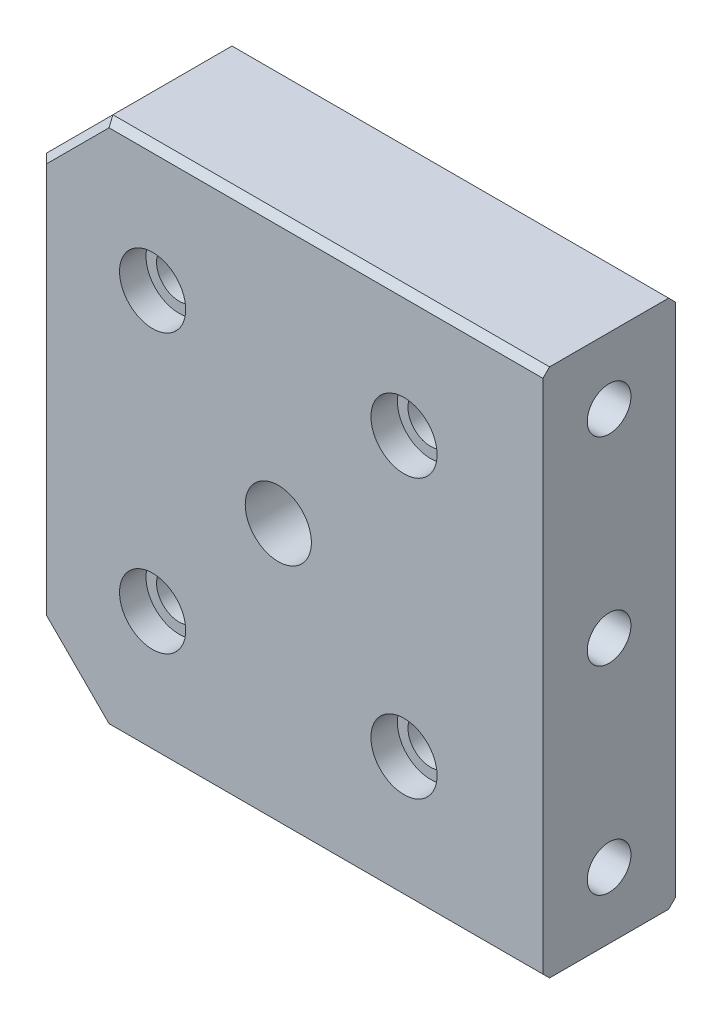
ISO-10303-21;
HEADER;
FILE_DESCRIPTION(('STEP AP214'),'2;1');
FILE_NAME('part.step','',(''),(''),'','','');
FILE_SCHEMA(('AUTOMOTIVE_DESIGN { 1 0 10303 214 1 1 1 1 }'));
ENDSEC;
DATA;
#1=APPLICATION_CONTEXT('core data for automotive mechanical design processes');
#2=APPLICATION_PROTOCOL_DEFINITION('international standard','automotive_design',2000,#1);
#3=PRODUCT_CONTEXT('',#1,'mechanical');
#4=PRODUCT('Part','Part','',(#3));
#5=PRODUCT_RELATED_PRODUCT_CATEGORY('part','',(#4));
#6=PRODUCT_DEFINITION_FORMATION('','',#4);
#7=PRODUCT_DEFINITION_CONTEXT('part definition',#1,'design');
#8=PRODUCT_DEFINITION('design','',#6,#7);
#9=PRODUCT_DEFINITION_SHAPE('','',#8);
#10=(LENGTH_UNIT() NAMED_UNIT(*) SI_UNIT(.MILLI.,.METRE.));
#11=(NAMED_UNIT(*) PLANE_ANGLE_UNIT() SI_UNIT($,.RADIAN.));
#12=(NAMED_UNIT(*) SI_UNIT($,.STERADIAN.) SOLID_ANGLE_UNIT());
#13=UNCERTAINTY_MEASURE_WITH_UNIT(LENGTH_MEASURE(1.E-05),#10,'distance_accuracy_value','');
#14=(GEOMETRIC_REPRESENTATION_CONTEXT(3) GLOBAL_UNCERTAINTY_ASSIGNED_CONTEXT((#13)) GLOBAL_UNIT_ASSIGNED_CONTEXT((#10,
#11,#12)) REPRESENTATION_CONTEXT('',''));
#15=CARTESIAN_POINT('',(0.,0.,0.));
#16=DIRECTION('',(0.,0.,1.));
#17=DIRECTION('',(1.,0.,0.));
#18=AXIS2_PLACEMENT_3D('',#15,#16,#17);
#19=CARTESIAN_POINT('',(2.,-10.5,0.));
#20=DIRECTION('',(0.,0.,-1.));
#21=DIRECTION('',(-1.,0.,0.));
#22=AXIS2_PLACEMENT_3D('',#19,#20,#21);
#23=CYLINDRICAL_SURFACE('',#22,1.7);
#24=CARTESIAN_POINT('',(2.,-10.5,3.4));
#25=DIRECTION('',(0.,0.,-1.));
#26=DIRECTION('',(-1.,0.,0.));
#27=AXIS2_PLACEMENT_3D('',#24,#25,#26);
#28=CIRCLE('',#27,1.7);
#29=CARTESIAN_POINT('',(0.3,-10.5,3.4));
#30=VERTEX_POINT('',#29);
#31=EDGE_CURVE('E178',#30,#30,#28,.T.);
#32=ORIENTED_EDGE('',*,*,#31,.T.);
#33=EDGE_LOOP('',(#32));
#34=FACE_BOUND('',#33,.T.);
#35=CARTESIAN_POINT('',(2.,-10.5,8.));
#36=DIRECTION('',(0.,0.,1.));
#37=DIRECTION('',(1.,0.,0.));
#38=AXIS2_PLACEMENT_3D('',#35,#36,#37);
#39=CIRCLE('',#38,1.7);
#40=CARTESIAN_POINT('',(3.7,-10.5,8.));
#41=VERTEX_POINT('',#40);
#42=EDGE_CURVE('E20',#41,#41,#39,.F.);
#43=ORIENTED_EDGE('',*,*,#42,.F.);
#44=EDGE_LOOP('',(#43));
#45=FACE_BOUND('',#44,.T.);
#46=ADVANCED_FACE('F16',(#34,#45),#23,.F.);
#47=CARTESIAN_POINT('',(2.,10.5,0.));
#48=DIRECTION('',(0.,0.,-1.));
#49=DIRECTION('',(-1.,0.,0.));
#50=AXIS2_PLACEMENT_3D('',#47,#48,#49);
#51=CYLINDRICAL_SURFACE('',#50,1.7);
#52=CARTESIAN_POINT('',(2.,10.5,3.4));
#53=DIRECTION('',(0.,0.,-1.));
#54=DIRECTION('',(-1.,0.,0.));
#55=AXIS2_PLACEMENT_3D('',#52,#53,#54);
#56=CIRCLE('',#55,1.7);
#57=CARTESIAN_POINT('',(0.3,10.5,3.4));
#58=VERTEX_POINT('',#57);
#59=EDGE_CURVE('E169',#58,#58,#56,.T.);
#60=ORIENTED_EDGE('',*,*,#59,.T.);
#61=EDGE_LOOP('',(#60));
#62=FACE_BOUND('',#61,.T.);
#63=CARTESIAN_POINT('',(2.,10.5,8.));
#64=DIRECTION('',(0.,0.,1.));
#65=DIRECTION('',(1.,0.,0.));
#66=AXIS2_PLACEMENT_3D('',#63,#64,#65);
#67=CIRCLE('',#66,1.7);
#68=CARTESIAN_POINT('',(3.7,10.5,8.));
#69=VERTEX_POINT('',#68);
#70=EDGE_CURVE('E282',#69,#69,#67,.F.);
#71=ORIENTED_EDGE('',*,*,#70,.F.);
#72=EDGE_LOOP('',(#71));
#73=FACE_BOUND('',#72,.T.);
#74=ADVANCED_FACE('F393',(#62,#73),#51,.F.);
#75=CARTESIAN_POINT('',(-17.,10.5,0.));
#76=DIRECTION('',(0.,0.,-1.));
#77=DIRECTION('',(-1.,0.,0.));
#78=AXIS2_PLACEMENT_3D('',#75,#76,#77);
#79=CYLINDRICAL_SURFACE('',#78,1.7);
#80=CARTESIAN_POINT('',(-17.,10.5,3.4));
#81=DIRECTION('',(0.,0.,-1.));
#82=DIRECTION('',(-1.,0.,0.));
#83=AXIS2_PLACEMENT_3D('',#80,#81,#82);
#84=CIRCLE('',#83,1.7);
#85=CARTESIAN_POINT('',(-18.7,10.5,3.4));
#86=VERTEX_POINT('',#85);
#87=EDGE_CURVE('E160',#86,#86,#84,.T.);
#88=ORIENTED_EDGE('',*,*,#87,.T.);
#89=EDGE_LOOP('',(#88));
#90=FACE_BOUND('',#89,.T.);
#91=CARTESIAN_POINT('',(-17.,10.5,8.));
#92=DIRECTION('',(0.,0.,1.));
#93=DIRECTION('',(1.,0.,0.));
#94=AXIS2_PLACEMENT_3D('',#91,#92,#93);
#95=CIRCLE('',#94,1.7);
#96=CARTESIAN_POINT('',(-15.3,10.5,8.));
#97=VERTEX_POINT('',#96);
#98=EDGE_CURVE('E278',#97,#97,#95,.F.);
#99=ORIENTED_EDGE('',*,*,#98,.F.);
#100=EDGE_LOOP('',(#99));
#101=FACE_BOUND('',#100,.T.);
#102=ADVANCED_FACE('F400',(#90,#101),#79,.F.);
#103=CARTESIAN_POINT('',(-17.,-10.5,0.));
#104=DIRECTION('',(0.,0.,-1.));
#105=DIRECTION('',(-1.,0.,0.));
#106=AXIS2_PLACEMENT_3D('',#103,#104,#105);
#107=CYLINDRICAL_SURFACE('',#106,1.7);
#108=CARTESIAN_POINT('',(-17.,-10.5,3.4));
#109=DIRECTION('',(0.,0.,-1.));
#110=DIRECTION('',(-1.,0.,0.));
#111=AXIS2_PLACEMENT_3D('',#108,#109,#110);
#112=CIRCLE('',#111,1.7);
#113=CARTESIAN_POINT('',(-18.7,-10.5,3.4));
#114=VERTEX_POINT('',#113);
#115=EDGE_CURVE('E151',#114,#114,#112,.T.);
#116=ORIENTED_EDGE('',*,*,#115,.T.);
#117=EDGE_LOOP('',(#116));
#118=FACE_BOUND('',#117,.T.);
#119=CARTESIAN_POINT('',(-17.,-10.5,8.));
#120=DIRECTION('',(0.,0.,1.));
#121=DIRECTION('',(1.,0.,0.));
#122=AXIS2_PLACEMENT_3D('',#119,#120,#121);
#123=CIRCLE('',#122,1.7);
#124=CARTESIAN_POINT('',(-15.3,-10.5,8.));
#125=VERTEX_POINT('',#124);
#126=EDGE_CURVE('E267',#125,#125,#123,.F.);
#127=ORIENTED_EDGE('',*,*,#126,.F.);
#128=EDGE_LOOP('',(#127));
#129=FACE_BOUND('',#128,.T.);
#130=ADVANCED_FACE('F419',(#118,#129),#107,.F.);
#131=CARTESIAN_POINT('',(12.5,20.,10.));
#132=DIRECTION('',(-1.,0.,0.));
#133=DIRECTION('',(0.,-1.,0.));
#134=AXIS2_PLACEMENT_3D('',#131,#132,#133);
#135=PLANE('',#134);
#136=CARTESIAN_POINT('',(12.5,-15.,5.));
#137=DIRECTION('',(1.,0.,0.));
#138=DIRECTION('',(0.,0.,-1.));
#139=AXIS2_PLACEMENT_3D('',#136,#137,#138);
#140=CIRCLE('',#139,1.65);
#141=CARTESIAN_POINT('',(12.5,-15.,3.35));
#142=VERTEX_POINT('',#141);
#143=EDGE_CURVE('E121',#142,#142,#140,.T.);
#144=ORIENTED_EDGE('',*,*,#143,.F.);
#145=EDGE_LOOP('',(#144));
#146=FACE_BOUND('',#145,.T.);
#147=CARTESIAN_POINT('',(12.5,0.,5.));
#148=DIRECTION('',(1.,0.,0.));
#149=DIRECTION('',(0.,0.,-1.));
#150=AXIS2_PLACEMENT_3D('',#147,#148,#149);
#151=CIRCLE('',#150,1.65);
#152=CARTESIAN_POINT('',(12.5,0.,3.35));
#153=VERTEX_POINT('',#152);
#154=EDGE_CURVE('E120',#153,#153,#151,.T.);
#155=ORIENTED_EDGE('',*,*,#154,.F.);
#156=EDGE_LOOP('',(#155));
#157=FACE_BOUND('',#156,.T.);
#158=CARTESIAN_POINT('',(12.5,15.,5.));
#159=DIRECTION('',(1.,0.,0.));
#160=DIRECTION('',(0.,0.,-1.));
#161=AXIS2_PLACEMENT_3D('',#158,#159,#160);
#162=CIRCLE('',#161,1.65);
#163=CARTESIAN_POINT('',(12.5,15.,3.35));
#164=VERTEX_POINT('',#163);
#165=EDGE_CURVE('E133',#164,#164,#162,.T.);
#166=ORIENTED_EDGE('',*,*,#165,.F.);
#167=EDGE_LOOP('',(#166));
#168=FACE_BOUND('',#167,.T.);
#169=DIRECTION('',(0.,0.,-1.));
#170=VECTOR('',#169,1.);
#171=CARTESIAN_POINT('',(12.5,20.,10.));
#172=LINE('',#171,#170);
#173=CARTESIAN_POINT('',(12.5,20.,9.5));
#174=VERTEX_POINT('',#173);
#175=CARTESIAN_POINT('',(12.5,20.,0.5));
#176=VERTEX_POINT('',#175);
#177=EDGE_CURVE('E188',#174,#176,#172,.T.);
#178=ORIENTED_EDGE('',*,*,#177,.F.);
#179=DIRECTION('',(0.,-0.707106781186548,0.707106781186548));
#180=VECTOR('',#179,1.);
#181=CARTESIAN_POINT('',(12.5,19.5,10.));
#182=LINE('',#181,#180);
#183=CARTESIAN_POINT('',(12.5,19.5,10.));
#184=VERTEX_POINT('',#183);
#185=EDGE_CURVE('E226',#174,#184,#182,.T.);
#186=ORIENTED_EDGE('',*,*,#185,.T.);
#187=DIRECTION('',(0.,1.,0.));
#188=VECTOR('',#187,1.);
#189=CARTESIAN_POINT('',(12.5,20.,10.));
#190=LINE('',#189,#188);
#191=CARTESIAN_POINT('',(12.5,-19.5,10.));
#192=VERTEX_POINT('',#191);
#193=EDGE_CURVE('E184',#192,#184,#190,.T.);
#194=ORIENTED_EDGE('',*,*,#193,.F.);
#195=DIRECTION('',(0.,-0.707106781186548,-0.707106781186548));
#196=VECTOR('',#195,1.);
#197=CARTESIAN_POINT('',(12.5,-19.5,10.));
#198=LINE('',#197,#196);
#199=CARTESIAN_POINT('',(12.5,-20.,9.5));
#200=VERTEX_POINT('',#199);
#201=EDGE_CURVE('E224',#192,#200,#198,.T.);
#202=ORIENTED_EDGE('',*,*,#201,.T.);
#203=DIRECTION('',(0.,0.,-1.));
#204=VECTOR('',#203,1.);
#205=CARTESIAN_POINT('',(12.5,-20.,10.));
#206=LINE('',#205,#204);
#207=CARTESIAN_POINT('',(12.5,-20.,0.5));
#208=VERTEX_POINT('',#207);
#209=EDGE_CURVE('E185',#200,#208,#206,.T.);
#210=ORIENTED_EDGE('',*,*,#209,.T.);
#211=DIRECTION('',(0.,-0.707106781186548,0.707106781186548));
#212=VECTOR('',#211,1.);
#213=CARTESIAN_POINT('',(12.5,-20.,0.5));
#214=LINE('',#213,#212);
#215=CARTESIAN_POINT('',(12.5,-19.5,0.));
#216=VERTEX_POINT('',#215);
#217=EDGE_CURVE('E222',#208,#216,#214,.F.);
#218=ORIENTED_EDGE('',*,*,#217,.T.);
#219=DIRECTION('',(0.,1.,0.));
#220=VECTOR('',#219,1.);
#221=CARTESIAN_POINT('',(12.5,20.,0.));
#222=LINE('',#221,#220);
#223=CARTESIAN_POINT('',(12.5,19.5,0.));
#224=VERTEX_POINT('',#223);
#225=EDGE_CURVE('E181',#216,#224,#222,.T.);
#226=ORIENTED_EDGE('',*,*,#225,.T.);
#227=DIRECTION('',(0.,-0.707106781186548,-0.707106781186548));
#228=VECTOR('',#227,1.);
#229=CARTESIAN_POINT('',(12.5,20.,0.500000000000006));
#230=LINE('',#229,#228);
#231=EDGE_CURVE('E220',#224,#176,#230,.F.);
#232=ORIENTED_EDGE('',*,*,#231,.T.);
#233=EDGE_LOOP('',(#178,#186,#194,#202,#210,#218,#226,#232));
#234=FACE_BOUND('',#233,.T.);
#235=ADVANCED_FACE('F348',(#146,#157,#168,#234),#135,.F.);
#236=CARTESIAN_POINT('',(-27.5,20.,10.));
#237=DIRECTION('',(0.,-1.,0.));
#238=DIRECTION('',(0.,0.,-1.));
#239=AXIS2_PLACEMENT_3D('',#236,#237,#238);
#240=PLANE('',#239);
#241=DIRECTION('',(0.,0.,1.));
#242=VECTOR('',#241,1.);
#243=CARTESIAN_POINT('',(-20.5,20.,10.));
#244=LINE('',#243,#242);
#245=CARTESIAN_POINT('',(-20.5,20.,0.5));
#246=VERTEX_POINT('',#245);
#247=CARTESIAN_POINT('',(-20.5,20.,9.5));
#248=VERTEX_POINT('',#247);
#249=EDGE_CURVE('E199',#246,#248,#244,.T.);
#250=ORIENTED_EDGE('',*,*,#249,.T.);
#251=DIRECTION('',(1.,0.,0.));
#252=VECTOR('',#251,1.);
#253=CARTESIAN_POINT('',(12.5,20.,9.5));
#254=LINE('',#253,#252);
#255=EDGE_CURVE('E218',#248,#174,#254,.T.);
#256=ORIENTED_EDGE('',*,*,#255,.T.);
#257=ORIENTED_EDGE('',*,*,#177,.T.);
#258=DIRECTION('',(-1.,0.,0.));
#259=VECTOR('',#258,1.);
#260=CARTESIAN_POINT('',(-27.5,20.,0.5));
#261=LINE('',#260,#259);
#262=EDGE_CURVE('E216',#176,#246,#261,.T.);
#263=ORIENTED_EDGE('',*,*,#262,.T.);
#264=EDGE_LOOP('',(#250,#256,#257,#263));
#265=FACE_BOUND('',#264,.T.);
#266=ADVANCED_FACE('F413',(#265),#240,.F.);
#267=CARTESIAN_POINT('',(-25.5,20.,10.));
#268=DIRECTION('',(1.,0.,0.));
#269=DIRECTION('',(0.,1.,0.));
#270=AXIS2_PLACEMENT_3D('',#267,#268,#269);
#271=PLANE('',#270);
#272=DIRECTION('',(0.,0.,1.));
#273=VECTOR('',#272,1.);
#274=CARTESIAN_POINT('',(-25.5,-15.,10.));
#275=LINE('',#274,#273);
#276=CARTESIAN_POINT('',(-25.5,-15.,0.5));
#277=VERTEX_POINT('',#276);
#278=CARTESIAN_POINT('',(-25.5,-15.,9.5));
#279=VERTEX_POINT('',#278);
#280=EDGE_CURVE('E193',#277,#279,#275,.T.);
#281=ORIENTED_EDGE('',*,*,#280,.T.);
#282=DIRECTION('',(0.,1.,0.));
#283=VECTOR('',#282,1.);
#284=CARTESIAN_POINT('',(-25.5,15.,9.5));
#285=LINE('',#284,#283);
#286=CARTESIAN_POINT('',(-25.5,15.,9.5));
#287=VERTEX_POINT('',#286);
#288=EDGE_CURVE('E234',#279,#287,#285,.T.);
#289=ORIENTED_EDGE('',*,*,#288,.T.);
#290=DIRECTION('',(0.,0.,-1.));
#291=VECTOR('',#290,1.);
#292=CARTESIAN_POINT('',(-25.5,15.,10.));
#293=LINE('',#292,#291);
#294=CARTESIAN_POINT('',(-25.5,15.,0.5));
#295=VERTEX_POINT('',#294);
#296=EDGE_CURVE('E196',#287,#295,#293,.T.);
#297=ORIENTED_EDGE('',*,*,#296,.T.);
#298=DIRECTION('',(0.,-1.,0.));
#299=VECTOR('',#298,1.);
#300=CARTESIAN_POINT('',(-25.5,20.,0.5));
#301=LINE('',#300,#299);
#302=EDGE_CURVE('E232',#295,#277,#301,.T.);
#303=ORIENTED_EDGE('',*,*,#302,.T.);
#304=EDGE_LOOP('',(#281,#289,#297,#303));
#305=FACE_BOUND('',#304,.T.);
#306=ADVANCED_FACE('F371',(#305),#271,.F.);
#307=CARTESIAN_POINT('',(-27.5,-20.,10.));
#308=DIRECTION('',(0.,1.,0.));
#309=DIRECTION('',(0.,0.,1.));
#310=AXIS2_PLACEMENT_3D('',#307,#308,#309);
#311=PLANE('',#310);
#312=ORIENTED_EDGE('',*,*,#209,.F.);
#313=DIRECTION('',(-1.,0.,0.));
#314=VECTOR('',#313,1.);
#315=CARTESIAN_POINT('',(-20.5,-20.,9.5));
#316=LINE('',#315,#314);
#317=CARTESIAN_POINT('',(-20.5,-20.,9.5));
#318=VERTEX_POINT('',#317);
#319=EDGE_CURVE('E243',#200,#318,#316,.T.);
#320=ORIENTED_EDGE('',*,*,#319,.T.);
#321=DIRECTION('',(0.,0.,-1.));
#322=VECTOR('',#321,1.);
#323=CARTESIAN_POINT('',(-20.5,-20.,10.));
#324=LINE('',#323,#322);
#325=CARTESIAN_POINT('',(-20.5,-20.,0.5));
#326=VERTEX_POINT('',#325);
#327=EDGE_CURVE('E202',#318,#326,#324,.T.);
#328=ORIENTED_EDGE('',*,*,#327,.T.);
#329=DIRECTION('',(1.,0.,0.));
#330=VECTOR('',#329,1.);
#331=CARTESIAN_POINT('',(-27.5,-20.,0.5));
#332=LINE('',#331,#330);
#333=EDGE_CURVE('E240',#326,#208,#332,.T.);
#334=ORIENTED_EDGE('',*,*,#333,.T.);
#335=EDGE_LOOP('',(#312,#320,#328,#334));
#336=FACE_BOUND('',#335,.T.);
#337=ADVANCED_FACE('F313',(#336),#311,.F.);
#338=CARTESIAN_POINT('',(0.,0.,10.));
#339=DIRECTION('',(0.,0.,1.));
#340=DIRECTION('',(1.,0.,0.));
#341=AXIS2_PLACEMENT_3D('',#338,#339,#340);
#342=PLANE('',#341);
#343=CARTESIAN_POINT('',(2.,-10.5,10.));
#344=DIRECTION('',(0.,0.,1.));
#345=DIRECTION('',(1.,0.,0.));
#346=AXIS2_PLACEMENT_3D('',#343,#344,#345);
#347=CIRCLE('',#346,2.5);
#348=CARTESIAN_POINT('',(4.5,-10.5,10.));
#349=VERTEX_POINT('',#348);
#350=EDGE_CURVE('E298',#349,#349,#347,.T.);
#351=ORIENTED_EDGE('',*,*,#350,.F.);
#352=EDGE_LOOP('',(#351));
#353=FACE_BOUND('',#352,.T.);
#354=CARTESIAN_POINT('',(2.,10.5,10.));
#355=DIRECTION('',(0.,0.,1.));
#356=DIRECTION('',(1.,0.,0.));
#357=AXIS2_PLACEMENT_3D('',#354,#355,#356);
#358=CIRCLE('',#357,2.5);
#359=CARTESIAN_POINT('',(4.5,10.5,10.));
#360=VERTEX_POINT('',#359);
#361=EDGE_CURVE('E291',#360,#360,#358,.T.);
#362=ORIENTED_EDGE('',*,*,#361,.F.);
#363=EDGE_LOOP('',(#362));
#364=FACE_BOUND('',#363,.T.);
#365=CARTESIAN_POINT('',(-17.,10.5,10.));
#366=DIRECTION('',(0.,0.,1.));
#367=DIRECTION('',(1.,0.,0.));
#368=AXIS2_PLACEMENT_3D('',#365,#366,#367);
#369=CIRCLE('',#368,2.5);
#370=CARTESIAN_POINT('',(-14.5,10.5,10.));
#371=VERTEX_POINT('',#370);
#372=EDGE_CURVE('E284',#371,#371,#369,.T.);
#373=ORIENTED_EDGE('',*,*,#372,.F.);
#374=EDGE_LOOP('',(#373));
#375=FACE_BOUND('',#374,.T.);
#376=CARTESIAN_POINT('',(-17.,-10.5,10.));
#377=DIRECTION('',(0.,0.,1.));
#378=DIRECTION('',(1.,0.,0.));
#379=AXIS2_PLACEMENT_3D('',#376,#377,#378);
#380=CIRCLE('',#379,2.5);
#381=CARTESIAN_POINT('',(-14.5,-10.5,10.));
#382=VERTEX_POINT('',#381);
#383=EDGE_CURVE('E280',#382,#382,#380,.T.);
#384=ORIENTED_EDGE('',*,*,#383,.F.);
#385=EDGE_LOOP('',(#384));
#386=FACE_BOUND('',#385,.T.);
#387=CARTESIAN_POINT('',(-7.5,0.,10.));
#388=DIRECTION('',(0.,0.,-1.));
#389=DIRECTION('',(-1.,0.,0.));
#390=AXIS2_PLACEMENT_3D('',#387,#388,#389);
#391=CIRCLE('',#390,2.5);
#392=CARTESIAN_POINT('',(-10.,0.,10.));
#393=VERTEX_POINT('',#392);
#394=EDGE_CURVE('E142',#393,#393,#391,.T.);
#395=ORIENTED_EDGE('',*,*,#394,.T.);
#396=EDGE_LOOP('',(#395));
#397=FACE_BOUND('',#396,.T.);
#398=ORIENTED_EDGE('',*,*,#193,.T.);
#399=DIRECTION('',(-1.,0.,0.));
#400=VECTOR('',#399,1.);
#401=CARTESIAN_POINT('',(-20.5,19.5,10.));
#402=LINE('',#401,#400);
#403=CARTESIAN_POINT('',(-20.2928932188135,19.5,10.));
#404=VERTEX_POINT('',#403);
#405=EDGE_CURVE('E213',#184,#404,#402,.T.);
#406=ORIENTED_EDGE('',*,*,#405,.T.);
#407=DIRECTION('',(-0.707106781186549,-0.707106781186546,0.));
#408=VECTOR('',#407,1.);
#409=CARTESIAN_POINT('',(-19.8964466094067,19.8964466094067,10.));
#410=LINE('',#409,#408);
#411=CARTESIAN_POINT('',(-25.,14.7928932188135,10.));
#412=VERTEX_POINT('',#411);
#413=EDGE_CURVE('E211',#404,#412,#410,.T.);
#414=ORIENTED_EDGE('',*,*,#413,.T.);
#415=DIRECTION('',(0.,-1.,0.));
#416=VECTOR('',#415,1.);
#417=CARTESIAN_POINT('',(-25.,-15.,10.));
#418=LINE('',#417,#416);
#419=CARTESIAN_POINT('',(-25.,-14.7928932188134,10.));
#420=VERTEX_POINT('',#419);
#421=EDGE_CURVE('E209',#412,#420,#418,.T.);
#422=ORIENTED_EDGE('',*,*,#421,.T.);
#423=DIRECTION('',(0.707106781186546,-0.707106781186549,0.));
#424=VECTOR('',#423,1.);
#425=CARTESIAN_POINT('',(-19.8964466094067,-19.8964466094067,10.));
#426=LINE('',#425,#424);
#427=CARTESIAN_POINT('',(-20.2928932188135,-19.5,10.));
#428=VERTEX_POINT('',#427);
#429=EDGE_CURVE('E207',#420,#428,#426,.T.);
#430=ORIENTED_EDGE('',*,*,#429,.T.);
#431=DIRECTION('',(1.,0.,0.));
#432=VECTOR('',#431,1.);
#433=CARTESIAN_POINT('',(12.5,-19.5,10.));
#434=LINE('',#433,#432);
#435=EDGE_CURVE('E205',#428,#192,#434,.T.);
#436=ORIENTED_EDGE('',*,*,#435,.T.);
#437=EDGE_LOOP('',(#398,#406,#414,#422,#430,#436));
#438=FACE_BOUND('',#437,.T.);
#439=ADVANCED_FACE('F309',(#353,#364,#375,#386,#397,#438),#342,.T.);
#440=CARTESIAN_POINT('',(0.,0.,0.));
#441=DIRECTION('',(0.,0.,1.));
#442=DIRECTION('',(1.,0.,0.));
#443=AXIS2_PLACEMENT_3D('',#440,#441,#442);
#444=PLANE('',#443);
#445=CARTESIAN_POINT('',(-7.5,0.,0.));
#446=DIRECTION('',(0.,0.,-1.));
#447=DIRECTION('',(-1.,0.,0.));
#448=AXIS2_PLACEMENT_3D('',#445,#446,#447);
#449=CIRCLE('',#448,2.5);
#450=CARTESIAN_POINT('',(-10.,0.,0.));
#451=VERTEX_POINT('',#450);
#452=EDGE_CURVE('E139',#451,#451,#449,.T.);
#453=ORIENTED_EDGE('',*,*,#452,.F.);
#454=EDGE_LOOP('',(#453));
#455=FACE_BOUND('',#454,.T.);
#456=CARTESIAN_POINT('',(-17.,-10.5,0.));
#457=DIRECTION('',(0.,0.,-1.));
#458=DIRECTION('',(-1.,0.,0.));
#459=AXIS2_PLACEMENT_3D('',#456,#457,#458);
#460=CIRCLE('',#459,3.);
#461=CARTESIAN_POINT('',(-20.,-10.5,0.));
#462=VERTEX_POINT('',#461);
#463=EDGE_CURVE('E145',#462,#462,#460,.T.);
#464=ORIENTED_EDGE('',*,*,#463,.F.);
#465=EDGE_LOOP('',(#464));
#466=FACE_BOUND('',#465,.T.);
#467=CARTESIAN_POINT('',(-17.,10.5,0.));
#468=DIRECTION('',(0.,0.,-1.));
#469=DIRECTION('',(-1.,0.,0.));
#470=AXIS2_PLACEMENT_3D('',#467,#468,#469);
#471=CIRCLE('',#470,3.);
#472=CARTESIAN_POINT('',(-20.,10.5,0.));
#473=VERTEX_POINT('',#472);
#474=EDGE_CURVE('E154',#473,#473,#471,.T.);
#475=ORIENTED_EDGE('',*,*,#474,.F.);
#476=EDGE_LOOP('',(#475));
#477=FACE_BOUND('',#476,.T.);
#478=CARTESIAN_POINT('',(2.,10.5,0.));
#479=DIRECTION('',(0.,0.,-1.));
#480=DIRECTION('',(-1.,0.,0.));
#481=AXIS2_PLACEMENT_3D('',#478,#479,#480);
#482=CIRCLE('',#481,3.);
#483=CARTESIAN_POINT('',(-1.,10.5,0.));
#484=VERTEX_POINT('',#483);
#485=EDGE_CURVE('E163',#484,#484,#482,.T.);
#486=ORIENTED_EDGE('',*,*,#485,.F.);
#487=EDGE_LOOP('',(#486));
#488=FACE_BOUND('',#487,.T.);
#489=CARTESIAN_POINT('',(2.,-10.5,0.));
#490=DIRECTION('',(0.,0.,-1.));
#491=DIRECTION('',(-1.,0.,0.));
#492=AXIS2_PLACEMENT_3D('',#489,#490,#491);
#493=CIRCLE('',#492,3.);
#494=CARTESIAN_POINT('',(-1.,-10.5,0.));
#495=VERTEX_POINT('',#494);
#496=EDGE_CURVE('E172',#495,#495,#493,.T.);
#497=ORIENTED_EDGE('',*,*,#496,.F.);
#498=EDGE_LOOP('',(#497));
#499=FACE_BOUND('',#498,.T.);
#500=ORIENTED_EDGE('',*,*,#225,.F.);
#501=DIRECTION('',(-1.,0.,0.));
#502=VECTOR('',#501,1.);
#503=CARTESIAN_POINT('',(0.,-19.5,0.));
#504=LINE('',#503,#502);
#505=CARTESIAN_POINT('',(-20.2928932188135,-19.5,0.));
#506=VERTEX_POINT('',#505);
#507=EDGE_CURVE('E11',#216,#506,#504,.T.);
#508=ORIENTED_EDGE('',*,*,#507,.T.);
#509=DIRECTION('',(-0.707106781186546,0.707106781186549,0.));
#510=VECTOR('',#509,1.);
#511=CARTESIAN_POINT('',(-25.1464466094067,-14.6464466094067,0.));
#512=LINE('',#511,#510);
#513=CARTESIAN_POINT('',(-25.,-14.7928932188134,0.));
#514=VERTEX_POINT('',#513);
#515=EDGE_CURVE('E25',#506,#514,#512,.T.);
#516=ORIENTED_EDGE('',*,*,#515,.T.);
#517=DIRECTION('',(0.,1.,0.));
#518=VECTOR('',#517,1.);
#519=CARTESIAN_POINT('',(-25.,0.,0.));
#520=LINE('',#519,#518);
#521=CARTESIAN_POINT('',(-25.,14.7928932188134,0.));
#522=VERTEX_POINT('',#521);
#523=EDGE_CURVE('E249',#514,#522,#520,.T.);
#524=ORIENTED_EDGE('',*,*,#523,.T.);
#525=DIRECTION('',(0.707106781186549,0.707106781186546,0.));
#526=VECTOR('',#525,1.);
#527=CARTESIAN_POINT('',(-20.1464466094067,19.6464466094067,0.));
#528=LINE('',#527,#526);
#529=CARTESIAN_POINT('',(-20.2928932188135,19.5,0.));
#530=VERTEX_POINT('',#529);
#531=EDGE_CURVE('E247',#522,#530,#528,.T.);
#532=ORIENTED_EDGE('',*,*,#531,.T.);
#533=DIRECTION('',(1.,0.,0.));
#534=VECTOR('',#533,1.);
#535=CARTESIAN_POINT('',(0.,19.5,0.));
#536=LINE('',#535,#534);
#537=EDGE_CURVE('E245',#530,#224,#536,.T.);
#538=ORIENTED_EDGE('',*,*,#537,.T.);
#539=EDGE_LOOP('',(#500,#508,#516,#524,#532,#538));
#540=FACE_BOUND('',#539,.T.);
#541=ADVANCED_FACE('F312',(#455,#466,#477,#488,#499,#540),#444,.F.);
#542=CARTESIAN_POINT('',(3.7,-10.5,3.4));
#543=DIRECTION('',(0.,0.,1.));
#544=DIRECTION('',(1.,0.,0.));
#545=AXIS2_PLACEMENT_3D('',#542,#543,#544);
#546=PLANE('',#545);
#547=ORIENTED_EDGE('',*,*,#31,.F.);
#548=EDGE_LOOP('',(#547));
#549=FACE_BOUND('',#548,.T.);
#550=CARTESIAN_POINT('',(2.,-10.5,3.4));
#551=DIRECTION('',(0.,0.,-1.));
#552=DIRECTION('',(-1.,0.,0.));
#553=AXIS2_PLACEMENT_3D('',#550,#551,#552);
#554=CIRCLE('',#553,3.);
#555=CARTESIAN_POINT('',(-1.,-10.5,3.4));
#556=VERTEX_POINT('',#555);
#557=EDGE_CURVE('E175',#556,#556,#554,.T.);
#558=ORIENTED_EDGE('',*,*,#557,.T.);
#559=EDGE_LOOP('',(#558));
#560=FACE_BOUND('',#559,.T.);
#561=ADVANCED_FACE('F405',(#549,#560),#546,.F.);
#562=CARTESIAN_POINT('',(2.,-10.5,0.));
#563=DIRECTION('',(0.,0.,-1.));
#564=DIRECTION('',(-1.,0.,0.));
#565=AXIS2_PLACEMENT_3D('',#562,#563,#564);
#566=CYLINDRICAL_SURFACE('',#565,3.);
#567=ORIENTED_EDGE('',*,*,#557,.F.);
#568=EDGE_LOOP('',(#567));
#569=FACE_BOUND('',#568,.T.);
#570=ORIENTED_EDGE('',*,*,#496,.T.);
#571=EDGE_LOOP('',(#570));
#572=FACE_BOUND('',#571,.T.);
#573=ADVANCED_FACE('F671',(#569,#572),#566,.F.);
#574=CARTESIAN_POINT('',(3.7,10.5,3.4));
#575=DIRECTION('',(0.,0.,1.));
#576=DIRECTION('',(1.,0.,0.));
#577=AXIS2_PLACEMENT_3D('',#574,#575,#576);
#578=PLANE('',#577);
#579=ORIENTED_EDGE('',*,*,#59,.F.);
#580=EDGE_LOOP('',(#579));
#581=FACE_BOUND('',#580,.T.);
#582=CARTESIAN_POINT('',(2.,10.5,3.4));
#583=DIRECTION('',(0.,0.,-1.));
#584=DIRECTION('',(-1.,0.,0.));
#585=AXIS2_PLACEMENT_3D('',#582,#583,#584);
#586=CIRCLE('',#585,3.);
#587=CARTESIAN_POINT('',(-1.,10.5,3.4));
#588=VERTEX_POINT('',#587);
#589=EDGE_CURVE('E166',#588,#588,#586,.T.);
#590=ORIENTED_EDGE('',*,*,#589,.T.);
#591=EDGE_LOOP('',(#590));
#592=FACE_BOUND('',#591,.T.);
#593=ADVANCED_FACE('F663',(#581,#592),#578,.F.);
#594=CARTESIAN_POINT('',(2.,10.5,0.));
#595=DIRECTION('',(0.,0.,-1.));
#596=DIRECTION('',(-1.,0.,0.));
#597=AXIS2_PLACEMENT_3D('',#594,#595,#596);
#598=CYLINDRICAL_SURFACE('',#597,3.);
#599=ORIENTED_EDGE('',*,*,#589,.F.);
#600=EDGE_LOOP('',(#599));
#601=FACE_BOUND('',#600,.T.);
#602=ORIENTED_EDGE('',*,*,#485,.T.);
#603=EDGE_LOOP('',(#602));
#604=FACE_BOUND('',#603,.T.);
#605=ADVANCED_FACE('F655',(#601,#604),#598,.F.);
#606=CARTESIAN_POINT('',(-15.3,10.5,3.4));
#607=DIRECTION('',(0.,0.,1.));
#608=DIRECTION('',(1.,0.,0.));
#609=AXIS2_PLACEMENT_3D('',#606,#607,#608);
#610=PLANE('',#609);
#611=ORIENTED_EDGE('',*,*,#87,.F.);
#612=EDGE_LOOP('',(#611));
#613=FACE_BOUND('',#612,.T.);
#614=CARTESIAN_POINT('',(-17.,10.5,3.4));
#615=DIRECTION('',(0.,0.,-1.));
#616=DIRECTION('',(-1.,0.,0.));
#617=AXIS2_PLACEMENT_3D('',#614,#615,#616);
#618=CIRCLE('',#617,3.);
#619=CARTESIAN_POINT('',(-20.,10.5,3.4));
#620=VERTEX_POINT('',#619);
#621=EDGE_CURVE('E157',#620,#620,#618,.T.);
#622=ORIENTED_EDGE('',*,*,#621,.T.);
#623=EDGE_LOOP('',(#622));
#624=FACE_BOUND('',#623,.T.);
#625=ADVANCED_FACE('F647',(#613,#624),#610,.F.);
#626=CARTESIAN_POINT('',(-17.,10.5,0.));
#627=DIRECTION('',(0.,0.,-1.));
#628=DIRECTION('',(-1.,0.,0.));
#629=AXIS2_PLACEMENT_3D('',#626,#627,#628);
#630=CYLINDRICAL_SURFACE('',#629,3.);
#631=ORIENTED_EDGE('',*,*,#621,.F.);
#632=EDGE_LOOP('',(#631));
#633=FACE_BOUND('',#632,.T.);
#634=ORIENTED_EDGE('',*,*,#474,.T.);
#635=EDGE_LOOP('',(#634));
#636=FACE_BOUND('',#635,.T.);
#637=ADVANCED_FACE('F639',(#633,#636),#630,.F.);
#638=CARTESIAN_POINT('',(-15.3,-10.5,3.4));
#639=DIRECTION('',(0.,0.,1.));
#640=DIRECTION('',(1.,0.,0.));
#641=AXIS2_PLACEMENT_3D('',#638,#639,#640);
#642=PLANE('',#641);
#643=ORIENTED_EDGE('',*,*,#115,.F.);
#644=EDGE_LOOP('',(#643));
#645=FACE_BOUND('',#644,.T.);
#646=CARTESIAN_POINT('',(-17.,-10.5,3.4));
#647=DIRECTION('',(0.,0.,-1.));
#648=DIRECTION('',(-1.,0.,0.));
#649=AXIS2_PLACEMENT_3D('',#646,#647,#648);
#650=CIRCLE('',#649,3.);
#651=CARTESIAN_POINT('',(-20.,-10.5,3.4));
#652=VERTEX_POINT('',#651);
#653=EDGE_CURVE('E148',#652,#652,#650,.T.);
#654=ORIENTED_EDGE('',*,*,#653,.T.);
#655=EDGE_LOOP('',(#654));
#656=FACE_BOUND('',#655,.T.);
#657=ADVANCED_FACE('F631',(#645,#656),#642,.F.);
#658=CARTESIAN_POINT('',(-17.,-10.5,0.));
#659=DIRECTION('',(0.,0.,-1.));
#660=DIRECTION('',(-1.,0.,0.));
#661=AXIS2_PLACEMENT_3D('',#658,#659,#660);
#662=CYLINDRICAL_SURFACE('',#661,3.);
#663=ORIENTED_EDGE('',*,*,#653,.F.);
#664=EDGE_LOOP('',(#663));
#665=FACE_BOUND('',#664,.T.);
#666=ORIENTED_EDGE('',*,*,#463,.T.);
#667=EDGE_LOOP('',(#666));
#668=FACE_BOUND('',#667,.T.);
#669=ADVANCED_FACE('F623',(#665,#668),#662,.F.);
#670=CARTESIAN_POINT('',(-7.5,0.,0.));
#671=DIRECTION('',(0.,0.,-1.));
#672=DIRECTION('',(-1.,0.,0.));
#673=AXIS2_PLACEMENT_3D('',#670,#671,#672);
#674=CYLINDRICAL_SURFACE('',#673,2.5);
#675=ORIENTED_EDGE('',*,*,#394,.F.);
#676=EDGE_LOOP('',(#675));
#677=FACE_BOUND('',#676,.T.);
#678=ORIENTED_EDGE('',*,*,#452,.T.);
#679=EDGE_LOOP('',(#678));
#680=FACE_BOUND('',#679,.T.);
#681=ADVANCED_FACE('F615',(#677,#680),#674,.F.);
#682=CARTESIAN_POINT('',(2.4,15.,5.));
#683=DIRECTION('',(1.,0.,0.));
#684=DIRECTION('',(0.,0.,-1.));
#685=AXIS2_PLACEMENT_3D('',#682,#683,#684);
#686=CONICAL_SURFACE('',#685,1.65,1.02974425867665);
#687=CARTESIAN_POINT('',(1.40857997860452,15.,5.));
#688=VERTEX_POINT('',#687);
#689=VERTEX_LOOP('',#688);
#690=FACE_BOUND('',#689,.T.);
#691=CARTESIAN_POINT('',(2.4,15.,5.));
#692=DIRECTION('',(1.,0.,0.));
#693=DIRECTION('',(0.,0.,-1.));
#694=AXIS2_PLACEMENT_3D('',#691,#692,#693);
#695=CIRCLE('',#694,1.65);
#696=CARTESIAN_POINT('',(2.4,15.,3.35));
#697=VERTEX_POINT('',#696);
#698=EDGE_CURVE('E136',#697,#697,#695,.T.);
#699=ORIENTED_EDGE('',*,*,#698,.T.);
#700=EDGE_LOOP('',(#699));
#701=FACE_BOUND('',#700,.T.);
#702=ADVANCED_FACE('F607',(#690,#701),#686,.F.);
#703=CARTESIAN_POINT('',(12.5,15.,5.));
#704=DIRECTION('',(1.,0.,0.));
#705=DIRECTION('',(0.,0.,-1.));
#706=AXIS2_PLACEMENT_3D('',#703,#704,#705);
#707=CYLINDRICAL_SURFACE('',#706,1.65);
#708=ORIENTED_EDGE('',*,*,#698,.F.);
#709=EDGE_LOOP('',(#708));
#710=FACE_BOUND('',#709,.T.);
#711=ORIENTED_EDGE('',*,*,#165,.T.);
#712=EDGE_LOOP('',(#711));
#713=FACE_BOUND('',#712,.T.);
#714=ADVANCED_FACE('F599',(#710,#713),#707,.F.);
#715=CARTESIAN_POINT('',(2.4,0.,5.));
#716=DIRECTION('',(1.,0.,0.));
#717=DIRECTION('',(0.,0.,-1.));
#718=AXIS2_PLACEMENT_3D('',#715,#716,#717);
#719=CONICAL_SURFACE('',#718,1.65,1.02974425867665);
#720=CARTESIAN_POINT('',(1.40857997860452,0.,5.));
#721=VERTEX_POINT('',#720);
#722=VERTEX_LOOP('',#721);
#723=FACE_BOUND('',#722,.T.);
#724=CARTESIAN_POINT('',(2.4,0.,5.));
#725=DIRECTION('',(1.,0.,0.));
#726=DIRECTION('',(0.,0.,-1.));
#727=AXIS2_PLACEMENT_3D('',#724,#725,#726);
#728=CIRCLE('',#727,1.65);
#729=CARTESIAN_POINT('',(2.4,0.,3.35));
#730=VERTEX_POINT('',#729);
#731=EDGE_CURVE('E124',#730,#730,#728,.T.);
#732=ORIENTED_EDGE('',*,*,#731,.T.);
#733=EDGE_LOOP('',(#732));
#734=FACE_BOUND('',#733,.T.);
#735=ADVANCED_FACE('F591',(#723,#734),#719,.F.);
#736=CARTESIAN_POINT('',(12.5,0.,5.));
#737=DIRECTION('',(1.,0.,0.));
#738=DIRECTION('',(0.,0.,-1.));
#739=AXIS2_PLACEMENT_3D('',#736,#737,#738);
#740=CYLINDRICAL_SURFACE('',#739,1.65);
#741=ORIENTED_EDGE('',*,*,#731,.F.);
#742=EDGE_LOOP('',(#741));
#743=FACE_BOUND('',#742,.T.);
#744=ORIENTED_EDGE('',*,*,#154,.T.);
#745=EDGE_LOOP('',(#744));
#746=FACE_BOUND('',#745,.T.);
#747=ADVANCED_FACE('F114',(#743,#746),#740,.F.);
#748=CARTESIAN_POINT('',(2.4,-15.,5.));
#749=DIRECTION('',(1.,0.,0.));
#750=DIRECTION('',(0.,0.,-1.));
#751=AXIS2_PLACEMENT_3D('',#748,#749,#750);
#752=CONICAL_SURFACE('',#751,1.65,1.02974425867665);
#753=CARTESIAN_POINT('',(1.40857997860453,-15.,5.));
#754=VERTEX_POINT('',#753);
#755=VERTEX_LOOP('',#754);
#756=FACE_BOUND('',#755,.T.);
#757=CARTESIAN_POINT('',(2.4,-15.,5.));
#758=DIRECTION('',(1.,0.,0.));
#759=DIRECTION('',(0.,0.,-1.));
#760=AXIS2_PLACEMENT_3D('',#757,#758,#759);
#761=CIRCLE('',#760,1.65);
#762=CARTESIAN_POINT('',(2.4,-15.,3.35));
#763=VERTEX_POINT('',#762);
#764=EDGE_CURVE('E118',#763,#763,#761,.T.);
#765=ORIENTED_EDGE('',*,*,#764,.T.);
#766=EDGE_LOOP('',(#765));
#767=FACE_BOUND('',#766,.T.);
#768=ADVANCED_FACE('F110',(#756,#767),#752,.F.);
#769=CARTESIAN_POINT('',(12.5,-15.,5.));
#770=DIRECTION('',(1.,0.,0.));
#771=DIRECTION('',(0.,0.,-1.));
#772=AXIS2_PLACEMENT_3D('',#769,#770,#771);
#773=CYLINDRICAL_SURFACE('',#772,1.65);
#774=ORIENTED_EDGE('',*,*,#764,.F.);
#775=EDGE_LOOP('',(#774));
#776=FACE_BOUND('',#775,.T.);
#777=ORIENTED_EDGE('',*,*,#143,.T.);
#778=EDGE_LOOP('',(#777));
#779=FACE_BOUND('',#778,.T.);
#780=ADVANCED_FACE('F113',(#776,#779),#773,.F.);
#781=CARTESIAN_POINT('',(-25.5,15.,10.));
#782=DIRECTION('',(0.707106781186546,-0.707106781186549,0.));
#783=DIRECTION('',(0.,0.,-1.));
#784=AXIS2_PLACEMENT_3D('',#781,#782,#783);
#785=PLANE('',#784);
#786=ORIENTED_EDGE('',*,*,#296,.F.);
#787=DIRECTION('',(-0.707106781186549,-0.707106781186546,0.));
#788=VECTOR('',#787,1.);
#789=CARTESIAN_POINT('',(-25.5,15.,9.5));
#790=LINE('',#789,#788);
#791=EDGE_CURVE('E230',#287,#248,#790,.F.);
#792=ORIENTED_EDGE('',*,*,#791,.T.);
#793=ORIENTED_EDGE('',*,*,#249,.F.);
#794=DIRECTION('',(0.707106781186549,0.707106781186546,0.));
#795=VECTOR('',#794,1.);
#796=CARTESIAN_POINT('',(-25.5,15.,0.5));
#797=LINE('',#796,#795);
#798=EDGE_CURVE('E228',#246,#295,#797,.F.);
#799=ORIENTED_EDGE('',*,*,#798,.T.);
#800=EDGE_LOOP('',(#786,#792,#793,#799));
#801=FACE_BOUND('',#800,.T.);
#802=ADVANCED_FACE('F369',(#801),#785,.F.);
#803=CARTESIAN_POINT('',(-20.5,-20.,10.));
#804=DIRECTION('',(0.707106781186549,0.707106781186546,0.));
#805=DIRECTION('',(0.,0.,-1.));
#806=AXIS2_PLACEMENT_3D('',#803,#804,#805);
#807=PLANE('',#806);
#808=ORIENTED_EDGE('',*,*,#327,.F.);
#809=DIRECTION('',(0.707106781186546,-0.707106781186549,0.));
#810=VECTOR('',#809,1.);
#811=CARTESIAN_POINT('',(-20.5,-20.,9.5));
#812=LINE('',#811,#810);
#813=EDGE_CURVE('E238',#318,#279,#812,.F.);
#814=ORIENTED_EDGE('',*,*,#813,.T.);
#815=ORIENTED_EDGE('',*,*,#280,.F.);
#816=DIRECTION('',(-0.707106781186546,0.707106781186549,0.));
#817=VECTOR('',#816,1.);
#818=CARTESIAN_POINT('',(-20.5,-20.,0.5));
#819=LINE('',#818,#817);
#820=EDGE_CURVE('E236',#277,#326,#819,.F.);
#821=ORIENTED_EDGE('',*,*,#820,.T.);
#822=EDGE_LOOP('',(#808,#814,#815,#821));
#823=FACE_BOUND('',#822,.T.);
#824=ADVANCED_FACE('F375',(#823),#807,.F.);
#825=CARTESIAN_POINT('',(0.,-19.5,10.));
#826=DIRECTION('',(0.,-0.707106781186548,0.707106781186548));
#827=DIRECTION('',(-1.,0.,0.));
#828=AXIS2_PLACEMENT_3D('',#825,#826,#827);
#829=PLANE('',#828);
#830=ORIENTED_EDGE('',*,*,#201,.F.);
#831=ORIENTED_EDGE('',*,*,#435,.F.);
#832=DIRECTION('',(-0.281084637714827,-0.678598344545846,-0.678598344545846));
#833=VECTOR('',#832,1.);
#834=CARTESIAN_POINT('',(-18.6895806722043,-15.6292611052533,13.8707388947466));
#835=LINE('',#834,#833);
#836=EDGE_CURVE('E127',#318,#428,#835,.F.);
#837=ORIENTED_EDGE('',*,*,#836,.F.);
#838=ORIENTED_EDGE('',*,*,#319,.F.);
#839=EDGE_LOOP('',(#830,#831,#837,#838));
#840=FACE_BOUND('',#839,.T.);
#841=ADVANCED_FACE('F344',(#840),#829,.T.);
#842=CARTESIAN_POINT('',(-19.8964466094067,-19.8964466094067,10.));
#843=DIRECTION('',(-0.5,-0.5,0.70710678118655));
#844=DIRECTION('',(-0.707106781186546,0.707106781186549,0.));
#845=AXIS2_PLACEMENT_3D('',#842,#843,#844);
#846=PLANE('',#845);
#847=ORIENTED_EDGE('',*,*,#836,.T.);
#848=ORIENTED_EDGE('',*,*,#429,.F.);
#849=DIRECTION('',(-0.678598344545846,-0.281084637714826,-0.678598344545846));
#850=VECTOR('',#849,1.);
#851=CARTESIAN_POINT('',(-23.6233055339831,-14.2226476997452,11.3766944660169));
#852=LINE('',#851,#850);
#853=EDGE_CURVE('E258',#279,#420,#852,.F.);
#854=ORIENTED_EDGE('',*,*,#853,.F.);
#855=ORIENTED_EDGE('',*,*,#813,.F.);
#856=EDGE_LOOP('',(#847,#848,#854,#855));
#857=FACE_BOUND('',#856,.T.);
#858=ADVANCED_FACE('F341',(#857),#846,.T.);
#859=CARTESIAN_POINT('',(-25.,0.,10.));
#860=DIRECTION('',(-0.707106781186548,0.,0.707106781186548));
#861=DIRECTION('',(0.,1.,0.));
#862=AXIS2_PLACEMENT_3D('',#859,#860,#861);
#863=PLANE('',#862);
#864=ORIENTED_EDGE('',*,*,#853,.T.);
#865=ORIENTED_EDGE('',*,*,#421,.F.);
#866=DIRECTION('',(-0.678598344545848,0.281084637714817,-0.678598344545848));
#867=VECTOR('',#866,1.);
#868=CARTESIAN_POINT('',(-22.1783507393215,13.6241278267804,12.8216492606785));
#869=LINE('',#868,#867);
#870=EDGE_CURVE('E254',#287,#412,#869,.F.);
#871=ORIENTED_EDGE('',*,*,#870,.F.);
#872=ORIENTED_EDGE('',*,*,#288,.F.);
#873=EDGE_LOOP('',(#864,#865,#871,#872));
#874=FACE_BOUND('',#873,.T.);
#875=ADVANCED_FACE('F336',(#874),#863,.T.);
#876=CARTESIAN_POINT('',(-19.8964466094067,19.8964466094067,10.));
#877=DIRECTION('',(-0.5,0.5,0.707106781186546));
#878=DIRECTION('',(0.707106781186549,0.707106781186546,0.));
#879=AXIS2_PLACEMENT_3D('',#876,#877,#878);
#880=PLANE('',#879);
#881=ORIENTED_EDGE('',*,*,#870,.T.);
#882=ORIENTED_EDGE('',*,*,#413,.F.);
#883=DIRECTION('',(-0.281084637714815,0.678598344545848,-0.678598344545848));
#884=VECTOR('',#883,1.);
#885=CARTESIAN_POINT('',(-20.3371901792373,19.6069423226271,9.8930576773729));
#886=LINE('',#885,#884);
#887=EDGE_CURVE('E252',#248,#404,#886,.F.);
#888=ORIENTED_EDGE('',*,*,#887,.F.);
#889=ORIENTED_EDGE('',*,*,#791,.F.);
#890=EDGE_LOOP('',(#881,#882,#888,#889));
#891=FACE_BOUND('',#890,.T.);
#892=ADVANCED_FACE('F331',(#891),#880,.T.);
#893=CARTESIAN_POINT('',(0.,19.5,10.));
#894=DIRECTION('',(0.,0.707106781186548,0.707106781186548));
#895=DIRECTION('',(1.,0.,0.));
#896=AXIS2_PLACEMENT_3D('',#893,#894,#895);
#897=PLANE('',#896);
#898=ORIENTED_EDGE('',*,*,#185,.F.);
#899=ORIENTED_EDGE('',*,*,#255,.F.);
#900=ORIENTED_EDGE('',*,*,#887,.T.);
#901=ORIENTED_EDGE('',*,*,#405,.F.);
#902=EDGE_LOOP('',(#898,#899,#900,#901));
#903=FACE_BOUND('',#902,.T.);
#904=ADVANCED_FACE('F325',(#903),#897,.T.);
#905=CARTESIAN_POINT('',(-27.5,20.,0.5));
#906=DIRECTION('',(0.,-0.707106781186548,0.707106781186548));
#907=DIRECTION('',(-1.,0.,0.));
#908=AXIS2_PLACEMENT_3D('',#905,#906,#907);
#909=PLANE('',#908);
#910=ORIENTED_EDGE('',*,*,#231,.F.);
#911=ORIENTED_EDGE('',*,*,#537,.F.);
#912=DIRECTION('',(-0.281084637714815,0.678598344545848,0.678598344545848));
#913=VECTOR('',#912,1.);
#914=CARTESIAN_POINT('',(-21.0530600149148,21.3352049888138,1.8352049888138));
#915=LINE('',#914,#913);
#916=EDGE_CURVE('E255',#246,#530,#915,.F.);
#917=ORIENTED_EDGE('',*,*,#916,.F.);
#918=ORIENTED_EDGE('',*,*,#262,.F.);
#919=EDGE_LOOP('',(#910,#911,#917,#918));
#920=FACE_BOUND('',#919,.T.);
#921=ADVANCED_FACE('F18',(#920),#909,.F.);
#922=CARTESIAN_POINT('',(-19.8964466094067,19.8964466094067,0.));
#923=DIRECTION('',(0.5,-0.5,0.707106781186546));
#924=DIRECTION('',(0.707106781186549,0.707106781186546,0.));
#925=AXIS2_PLACEMENT_3D('',#922,#923,#924);
#926=PLANE('',#925);
#927=ORIENTED_EDGE('',*,*,#916,.T.);
#928=ORIENTED_EDGE('',*,*,#531,.F.);
#929=DIRECTION('',(-0.678598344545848,0.281084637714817,0.678598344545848));
#930=VECTOR('',#929,1.);
#931=CARTESIAN_POINT('',(-23.623305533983,14.2226476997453,-1.37669446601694));
#932=LINE('',#931,#930);
#933=EDGE_CURVE('E270',#295,#522,#932,.F.);
#934=ORIENTED_EDGE('',*,*,#933,.F.);
#935=ORIENTED_EDGE('',*,*,#798,.F.);
#936=EDGE_LOOP('',(#927,#928,#934,#935));
#937=FACE_BOUND('',#936,.T.);
#938=ADVANCED_FACE('F363',(#937),#926,.F.);
#939=CARTESIAN_POINT('',(-25.5,20.,0.5));
#940=DIRECTION('',(0.707106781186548,0.,0.707106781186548));
#941=DIRECTION('',(0.,-1.,0.));
#942=AXIS2_PLACEMENT_3D('',#939,#940,#941);
#943=PLANE('',#942);
#944=ORIENTED_EDGE('',*,*,#933,.T.);
#945=ORIENTED_EDGE('',*,*,#523,.F.);
#946=DIRECTION('',(-0.678598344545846,-0.281084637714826,0.678598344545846));
#947=VECTOR('',#946,1.);
#948=CARTESIAN_POINT('',(-18.8239750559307,-12.2346999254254,-6.17602494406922));
#949=LINE('',#948,#947);
#950=EDGE_CURVE('E266',#277,#514,#949,.F.);
#951=ORIENTED_EDGE('',*,*,#950,.F.);
#952=ORIENTED_EDGE('',*,*,#302,.F.);
#953=EDGE_LOOP('',(#944,#945,#951,#952));
#954=FACE_BOUND('',#953,.T.);
#955=ADVANCED_FACE('F378',(#954),#943,.F.);
#956=CARTESIAN_POINT('',(-19.8964466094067,-19.8964466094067,0.));
#957=DIRECTION('',(0.5,0.5,0.70710678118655));
#958=DIRECTION('',(-0.707106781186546,0.707106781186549,0.));
#959=AXIS2_PLACEMENT_3D('',#956,#957,#958);
#960=PLANE('',#959);
#961=ORIENTED_EDGE('',*,*,#950,.T.);
#962=ORIENTED_EDGE('',*,*,#515,.F.);
#963=DIRECTION('',(-0.281084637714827,-0.678598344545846,0.678598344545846));
#964=VECTOR('',#963,1.);
#965=CARTESIAN_POINT('',(-20.3371901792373,-19.6069423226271,0.106942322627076));
#966=LINE('',#965,#964);
#967=EDGE_CURVE('E263',#326,#506,#966,.F.);
#968=ORIENTED_EDGE('',*,*,#967,.F.);
#969=ORIENTED_EDGE('',*,*,#820,.F.);
#970=EDGE_LOOP('',(#961,#962,#968,#969));
#971=FACE_BOUND('',#970,.T.);
#972=ADVANCED_FACE('F380',(#971),#960,.F.);
#973=CARTESIAN_POINT('',(-27.5,-20.,0.5));
#974=DIRECTION('',(0.,0.707106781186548,0.707106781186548));
#975=DIRECTION('',(1.,0.,0.));
#976=AXIS2_PLACEMENT_3D('',#973,#974,#975);
#977=PLANE('',#976);
#978=ORIENTED_EDGE('',*,*,#967,.T.);
#979=ORIENTED_EDGE('',*,*,#507,.F.);
#980=ORIENTED_EDGE('',*,*,#217,.F.);
#981=ORIENTED_EDGE('',*,*,#333,.F.);
#982=EDGE_LOOP('',(#978,#979,#980,#981));
#983=FACE_BOUND('',#982,.T.);
#984=ADVANCED_FACE('F354',(#983),#977,.F.);
#985=CARTESIAN_POINT('',(-17.,-10.5,8.));
#986=DIRECTION('',(0.,0.,1.));
#987=DIRECTION('',(1.,0.,0.));
#988=AXIS2_PLACEMENT_3D('',#985,#986,#987);
#989=PLANE('',#988);
#990=CARTESIAN_POINT('',(-17.,-10.5,8.));
#991=DIRECTION('',(0.,0.,1.));
#992=DIRECTION('',(1.,0.,0.));
#993=AXIS2_PLACEMENT_3D('',#990,#991,#992);
#994=CIRCLE('',#993,2.5);
#995=CARTESIAN_POINT('',(-14.5,-10.5,8.));
#996=VERTEX_POINT('',#995);
#997=EDGE_CURVE('E277',#996,#996,#994,.T.);
#998=ORIENTED_EDGE('',*,*,#997,.T.);
#999=EDGE_LOOP('',(#998));
#1000=FACE_BOUND('',#999,.T.);
#1001=ORIENTED_EDGE('',*,*,#126,.T.);
#1002=EDGE_LOOP('',(#1001));
#1003=FACE_BOUND('',#1002,.T.);
#1004=ADVANCED_FACE('F389',(#1000,#1003),#989,.T.);
#1005=CARTESIAN_POINT('',(-17.,-10.5,8.));
#1006=DIRECTION('',(0.,0.,1.));
#1007=DIRECTION('',(1.,0.,0.));
#1008=AXIS2_PLACEMENT_3D('',#1005,#1006,#1007);
#1009=CYLINDRICAL_SURFACE('',#1008,2.5);
#1010=ORIENTED_EDGE('',*,*,#997,.F.);
#1011=EDGE_LOOP('',(#1010));
#1012=FACE_BOUND('',#1011,.T.);
#1013=ORIENTED_EDGE('',*,*,#383,.T.);
#1014=EDGE_LOOP('',(#1013));
#1015=FACE_BOUND('',#1014,.T.);
#1016=ADVANCED_FACE('F307',(#1012,#1015),#1009,.F.);
#1017=CARTESIAN_POINT('',(-17.,10.5,8.));
#1018=DIRECTION('',(0.,0.,1.));
#1019=DIRECTION('',(1.,0.,0.));
#1020=AXIS2_PLACEMENT_3D('',#1017,#1018,#1019);
#1021=PLANE('',#1020);
#1022=CARTESIAN_POINT('',(-17.,10.5,8.));
#1023=DIRECTION('',(0.,0.,1.));
#1024=DIRECTION('',(1.,0.,0.));
#1025=AXIS2_PLACEMENT_3D('',#1022,#1023,#1024);
#1026=CIRCLE('',#1025,2.5);
#1027=CARTESIAN_POINT('',(-14.5,10.5,8.));
#1028=VERTEX_POINT('',#1027);
#1029=EDGE_CURVE('E281',#1028,#1028,#1026,.T.);
#1030=ORIENTED_EDGE('',*,*,#1029,.T.);
#1031=EDGE_LOOP('',(#1030));
#1032=FACE_BOUND('',#1031,.T.);
#1033=ORIENTED_EDGE('',*,*,#98,.T.);
#1034=EDGE_LOOP('',(#1033));
#1035=FACE_BOUND('',#1034,.T.);
#1036=ADVANCED_FACE('F513',(#1032,#1035),#1021,.T.);
#1037=CARTESIAN_POINT('',(-17.,10.5,8.));
#1038=DIRECTION('',(0.,0.,1.));
#1039=DIRECTION('',(1.,0.,0.));
#1040=AXIS2_PLACEMENT_3D('',#1037,#1038,#1039);
#1041=CYLINDRICAL_SURFACE('',#1040,2.5);
#1042=ORIENTED_EDGE('',*,*,#1029,.F.);
#1043=EDGE_LOOP('',(#1042));
#1044=FACE_BOUND('',#1043,.T.);
#1045=ORIENTED_EDGE('',*,*,#372,.T.);
#1046=EDGE_LOOP('',(#1045));
#1047=FACE_BOUND('',#1046,.T.);
#1048=ADVANCED_FACE('F523',(#1044,#1047),#1041,.F.);
#1049=CARTESIAN_POINT('',(2.,10.5,8.));
#1050=DIRECTION('',(0.,0.,1.));
#1051=DIRECTION('',(1.,0.,0.));
#1052=AXIS2_PLACEMENT_3D('',#1049,#1050,#1051);
#1053=PLANE('',#1052);
#1054=CARTESIAN_POINT('',(2.,10.5,8.));
#1055=DIRECTION('',(0.,0.,1.));
#1056=DIRECTION('',(1.,0.,0.));
#1057=AXIS2_PLACEMENT_3D('',#1054,#1055,#1056);
#1058=CIRCLE('',#1057,2.5);
#1059=CARTESIAN_POINT('',(4.5,10.5,8.));
#1060=VERTEX_POINT('',#1059);
#1061=EDGE_CURVE('E285',#1060,#1060,#1058,.T.);
#1062=ORIENTED_EDGE('',*,*,#1061,.T.);
#1063=EDGE_LOOP('',(#1062));
#1064=FACE_BOUND('',#1063,.T.);
#1065=ORIENTED_EDGE('',*,*,#70,.T.);
#1066=EDGE_LOOP('',(#1065));
#1067=FACE_BOUND('',#1066,.T.);
#1068=ADVANCED_FACE('F533',(#1064,#1067),#1053,.T.);
#1069=CARTESIAN_POINT('',(2.,10.5,8.));
#1070=DIRECTION('',(0.,0.,1.));
#1071=DIRECTION('',(1.,0.,0.));
#1072=AXIS2_PLACEMENT_3D('',#1069,#1070,#1071);
#1073=CYLINDRICAL_SURFACE('',#1072,2.5);
#1074=ORIENTED_EDGE('',*,*,#1061,.F.);
#1075=EDGE_LOOP('',(#1074));
#1076=FACE_BOUND('',#1075,.T.);
#1077=ORIENTED_EDGE('',*,*,#361,.T.);
#1078=EDGE_LOOP('',(#1077));
#1079=FACE_BOUND('',#1078,.T.);
#1080=ADVANCED_FACE('F543',(#1076,#1079),#1073,.F.);
#1081=CARTESIAN_POINT('',(2.,-10.5,8.));
#1082=DIRECTION('',(0.,0.,1.));
#1083=DIRECTION('',(1.,0.,0.));
#1084=AXIS2_PLACEMENT_3D('',#1081,#1082,#1083);
#1085=PLANE('',#1084);
#1086=CARTESIAN_POINT('',(2.,-10.5,8.));
#1087=DIRECTION('',(0.,0.,1.));
#1088=DIRECTION('',(1.,0.,0.));
#1089=AXIS2_PLACEMENT_3D('',#1086,#1087,#1088);
#1090=CIRCLE('',#1089,2.5);
#1091=CARTESIAN_POINT('',(4.5,-10.5,8.));
#1092=VERTEX_POINT('',#1091);
#1093=EDGE_CURVE('E842',#1092,#1092,#1090,.T.);
#1094=ORIENTED_EDGE('',*,*,#1093,.T.);
#1095=EDGE_LOOP('',(#1094));
#1096=FACE_BOUND('',#1095,.T.);
#1097=ORIENTED_EDGE('',*,*,#42,.T.);
#1098=EDGE_LOOP('',(#1097));
#1099=FACE_BOUND('',#1098,.T.);
#1100=ADVANCED_FACE('F552',(#1096,#1099),#1085,.T.);
#1101=CARTESIAN_POINT('',(2.,-10.5,8.));
#1102=DIRECTION('',(0.,0.,1.));
#1103=DIRECTION('',(1.,0.,0.));
#1104=AXIS2_PLACEMENT_3D('',#1101,#1102,#1103);
#1105=CYLINDRICAL_SURFACE('',#1104,2.5);
#1106=ORIENTED_EDGE('',*,*,#1093,.F.);
#1107=EDGE_LOOP('',(#1106));
#1108=FACE_BOUND('',#1107,.T.);
#1109=ORIENTED_EDGE('',*,*,#350,.T.);
#1110=EDGE_LOOP('',(#1109));
#1111=FACE_BOUND('',#1110,.T.);
#1112=ADVANCED_FACE('F562',(#1108,#1111),#1105,.F.);
#1113=CLOSED_SHELL('',(#46,#74,#102,#130,#235,#266,#306,#337,#439,#541,#561,#573,#593,#605,#625,
#637,#657,#669,#681,#702,#714,#735,#747,#768,#780,#802,#824,#841,#858,#875,#892,#904,#921,#938,
#955,#972,#984,#1004,#1016,#1036,#1048,#1068,#1080,#1100,#1112));
#1114=MANIFOLD_SOLID_BREP('B1',#1113);
#1115=ADVANCED_BREP_SHAPE_REPRESENTATION('',(#18,#1114),#14);
#1116=SHAPE_DEFINITION_REPRESENTATION(#9,#1115);
ENDSEC;
END-ISO-10303-21;
